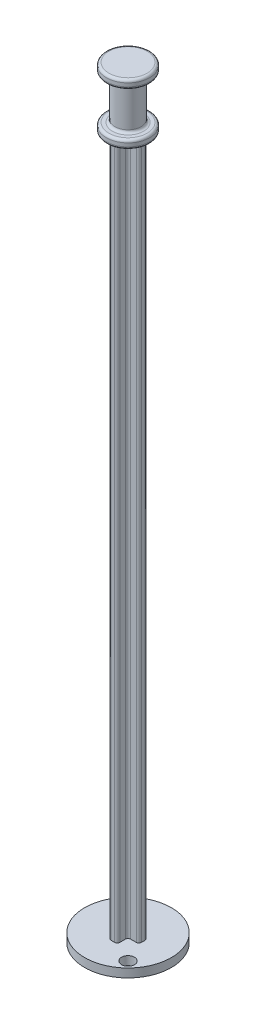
ISO-10303-21;
HEADER;
FILE_DESCRIPTION(('STEP AP214'),'2;1');
FILE_NAME('part.step','',(''),(''),'','','');
FILE_SCHEMA(('AUTOMOTIVE_DESIGN { 1 0 10303 214 1 1 1 1 }'));
ENDSEC;
DATA;
#1=APPLICATION_CONTEXT('core data for automotive mechanical design processes');
#2=APPLICATION_PROTOCOL_DEFINITION('international standard','automotive_design',2000,#1);
#3=PRODUCT_CONTEXT('',#1,'mechanical');
#4=PRODUCT('Part','Part','',(#3));
#5=PRODUCT_RELATED_PRODUCT_CATEGORY('part','',(#4));
#6=PRODUCT_DEFINITION_FORMATION('','',#4);
#7=PRODUCT_DEFINITION_CONTEXT('part definition',#1,'design');
#8=PRODUCT_DEFINITION('design','',#6,#7);
#9=PRODUCT_DEFINITION_SHAPE('','',#8);
#10=(LENGTH_UNIT() NAMED_UNIT(*) SI_UNIT(.MILLI.,.METRE.));
#11=(NAMED_UNIT(*) PLANE_ANGLE_UNIT() SI_UNIT($,.RADIAN.));
#12=(NAMED_UNIT(*) SI_UNIT($,.STERADIAN.) SOLID_ANGLE_UNIT());
#13=UNCERTAINTY_MEASURE_WITH_UNIT(LENGTH_MEASURE(1.E-05),#10,'distance_accuracy_value','');
#14=(GEOMETRIC_REPRESENTATION_CONTEXT(3) GLOBAL_UNCERTAINTY_ASSIGNED_CONTEXT((#13)) GLOBAL_UNIT_ASSIGNED_CONTEXT((#10,
#11,#12)) REPRESENTATION_CONTEXT('',''));
#15=CARTESIAN_POINT('',(0.,0.,0.));
#16=DIRECTION('',(0.,0.,1.));
#17=DIRECTION('',(1.,0.,0.));
#18=AXIS2_PLACEMENT_3D('',#15,#16,#17);
#19=CARTESIAN_POINT('',(0.,-81.,0.));
#20=DIRECTION('',(0.,1.,0.));
#21=DIRECTION('',(0.,0.,1.));
#22=AXIS2_PLACEMENT_3D('',#19,#20,#21);
#23=CYLINDRICAL_SURFACE('',#22,5.);
#24=CARTESIAN_POINT('',(0.,-81.,0.));
#25=DIRECTION('',(0.,-1.,0.));
#26=DIRECTION('',(0.,0.,-1.));
#27=AXIS2_PLACEMENT_3D('',#24,#25,#26);
#28=CIRCLE('',#27,5.);
#29=CARTESIAN_POINT('',(0.,-81.,-5.));
#30=VERTEX_POINT('',#29);
#31=EDGE_CURVE('E11',#30,#30,#28,.T.);
#32=ORIENTED_EDGE('',*,*,#31,.F.);
#33=EDGE_LOOP('',(#32));
#34=FACE_BOUND('',#33,.T.);
#35=CARTESIAN_POINT('',(0.,-80.,0.));
#36=DIRECTION('',(0.,-1.,0.));
#37=DIRECTION('',(0.,0.,-1.));
#38=AXIS2_PLACEMENT_3D('',#35,#36,#37);
#39=CIRCLE('',#38,5.);
#40=CARTESIAN_POINT('',(0.,-80.,-5.));
#41=VERTEX_POINT('',#40);
#42=EDGE_CURVE('E51',#41,#41,#39,.T.);
#43=ORIENTED_EDGE('',*,*,#42,.T.);
#44=EDGE_LOOP('',(#43));
#45=FACE_BOUND('',#44,.T.);
#46=ADVANCED_FACE('F44',(#34,#45),#23,.T.);
#47=CARTESIAN_POINT('',(0.,-81.,0.));
#48=DIRECTION('',(0.,-1.,0.));
#49=DIRECTION('',(0.,0.,-1.));
#50=AXIS2_PLACEMENT_3D('',#47,#48,#49);
#51=PLANE('',#50);
#52=CARTESIAN_POINT('',(2.82842712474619,-81.,2.82842712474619));
#53=DIRECTION('',(0.,-1.,0.));
#54=DIRECTION('',(0.,0.,-1.));
#55=AXIS2_PLACEMENT_3D('',#52,#53,#54);
#56=CIRCLE('',#55,0.75);
#57=CARTESIAN_POINT('',(2.82842712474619,-81.,2.07842712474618));
#58=VERTEX_POINT('',#57);
#59=EDGE_CURVE('E57',#58,#58,#56,.T.);
#60=ORIENTED_EDGE('',*,*,#59,.F.);
#61=EDGE_LOOP('',(#60));
#62=FACE_BOUND('',#61,.T.);
#63=ORIENTED_EDGE('',*,*,#31,.T.);
#64=EDGE_LOOP('',(#63));
#65=FACE_BOUND('',#64,.T.);
#66=ADVANCED_FACE('F73',(#62,#65),#51,.T.);
#67=CARTESIAN_POINT('',(0.,-80.,0.));
#68=DIRECTION('',(0.,-1.,0.));
#69=DIRECTION('',(0.,0.,-1.));
#70=AXIS2_PLACEMENT_3D('',#67,#68,#69);
#71=PLANE('',#70);
#72=CARTESIAN_POINT('',(2.82842712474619,-80.,2.82842712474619));
#73=DIRECTION('',(0.,-1.,0.));
#74=DIRECTION('',(0.,0.,-1.));
#75=AXIS2_PLACEMENT_3D('',#72,#73,#74);
#76=CIRCLE('',#75,0.75);
#77=CARTESIAN_POINT('',(2.82842712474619,-80.,2.07842712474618));
#78=VERTEX_POINT('',#77);
#79=EDGE_CURVE('E47',#78,#78,#76,.T.);
#80=ORIENTED_EDGE('',*,*,#79,.T.);
#81=EDGE_LOOP('',(#80));
#82=FACE_BOUND('',#81,.T.);
#83=ORIENTED_EDGE('',*,*,#42,.F.);
#84=EDGE_LOOP('',(#83));
#85=FACE_BOUND('',#84,.T.);
#86=ADVANCED_FACE('F64',(#82,#85),#71,.F.);
#87=CARTESIAN_POINT('',(2.82842712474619,-78.,2.82842712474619));
#88=DIRECTION('',(0.,-1.,0.));
#89=DIRECTION('',(0.,0.,-1.));
#90=AXIS2_PLACEMENT_3D('',#87,#88,#89);
#91=CYLINDRICAL_SURFACE('',#90,0.75);
#92=ORIENTED_EDGE('',*,*,#59,.T.);
#93=EDGE_LOOP('',(#92));
#94=FACE_BOUND('',#93,.T.);
#95=ORIENTED_EDGE('',*,*,#79,.F.);
#96=EDGE_LOOP('',(#95));
#97=FACE_BOUND('',#96,.T.);
#98=ADVANCED_FACE('F67',(#94,#97),#91,.F.);
#99=CLOSED_SHELL('',(#46,#66,#86,#98));
#100=MANIFOLD_SOLID_BREP('B2',#99);
#101=CARTESIAN_POINT('',(0.8,-80.,0.8));
#102=DIRECTION('',(0.,1.,0.));
#103=DIRECTION('',(0.,0.,1.));
#104=AXIS2_PLACEMENT_3D('',#101,#102,#103);
#105=CYLINDRICAL_SURFACE('',#104,0.3);
#106=CARTESIAN_POINT('',(0.8,0.,0.8));
#107=DIRECTION('',(0.,1.,0.));
#108=DIRECTION('',(0.,0.,1.));
#109=AXIS2_PLACEMENT_3D('',#106,#107,#108);
#110=CIRCLE('',#109,0.3);
#111=CARTESIAN_POINT('',(0.800000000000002,0.,0.500000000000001));
#112=VERTEX_POINT('',#111);
#113=CARTESIAN_POINT('',(0.5,0.,0.800000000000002));
#114=VERTEX_POINT('',#113);
#115=EDGE_CURVE('E305',#112,#114,#110,.T.);
#116=ORIENTED_EDGE('',*,*,#115,.T.);
#117=DIRECTION('',(0.,1.,0.));
#118=VECTOR('',#117,1.);
#119=CARTESIAN_POINT('',(0.5,-80.,0.800000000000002));
#120=LINE('',#119,#118);
#121=CARTESIAN_POINT('',(0.5,-80.,0.800000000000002));
#122=VERTEX_POINT('',#121);
#123=EDGE_CURVE('E42',#122,#114,#120,.T.);
#124=ORIENTED_EDGE('',*,*,#123,.F.);
#125=CARTESIAN_POINT('',(0.8,-80.,0.8));
#126=DIRECTION('',(0.,1.,0.));
#127=DIRECTION('',(0.,0.,1.));
#128=AXIS2_PLACEMENT_3D('',#125,#126,#127);
#129=CIRCLE('',#128,0.3);
#130=CARTESIAN_POINT('',(0.800000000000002,-80.,0.500000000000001));
#131=VERTEX_POINT('',#130);
#132=EDGE_CURVE('E351',#131,#122,#129,.T.);
#133=ORIENTED_EDGE('',*,*,#132,.F.);
#134=DIRECTION('',(0.,1.,0.));
#135=VECTOR('',#134,1.);
#136=CARTESIAN_POINT('',(0.800000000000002,-80.,0.500000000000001));
#137=LINE('',#136,#135);
#138=EDGE_CURVE('E301',#131,#112,#137,.T.);
#139=ORIENTED_EDGE('',*,*,#138,.T.);
#140=EDGE_LOOP('',(#116,#124,#133,#139));
#141=FACE_BOUND('',#140,.T.);
#142=ADVANCED_FACE('F113',(#141),#105,.F.);
#143=CARTESIAN_POINT('',(0.5,-80.,0.800000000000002));
#144=DIRECTION('',(-1.,0.,0.));
#145=DIRECTION('',(0.,0.,1.));
#146=AXIS2_PLACEMENT_3D('',#143,#144,#145);
#147=PLANE('',#146);
#148=DIRECTION('',(0.,0.,1.));
#149=VECTOR('',#148,1.);
#150=CARTESIAN_POINT('',(0.5,0.,0.800000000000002));
#151=LINE('',#150,#149);
#152=CARTESIAN_POINT('',(0.5,0.,1.45));
#153=VERTEX_POINT('',#152);
#154=EDGE_CURVE('E308',#114,#153,#151,.T.);
#155=ORIENTED_EDGE('',*,*,#154,.T.);
#156=DIRECTION('',(0.,1.,0.));
#157=VECTOR('',#156,1.);
#158=CARTESIAN_POINT('',(0.5,-80.,1.45));
#159=LINE('',#158,#157);
#160=CARTESIAN_POINT('',(0.5,-80.,1.45));
#161=VERTEX_POINT('',#160);
#162=EDGE_CURVE('E121',#161,#153,#159,.T.);
#163=ORIENTED_EDGE('',*,*,#162,.F.);
#164=DIRECTION('',(0.,0.,1.));
#165=VECTOR('',#164,1.);
#166=CARTESIAN_POINT('',(0.5,-80.,0.800000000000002));
#167=LINE('',#166,#165);
#168=EDGE_CURVE('E220',#122,#161,#167,.T.);
#169=ORIENTED_EDGE('',*,*,#168,.F.);
#170=ORIENTED_EDGE('',*,*,#123,.T.);
#171=EDGE_LOOP('',(#155,#163,#169,#170));
#172=FACE_BOUND('',#171,.T.);
#173=ADVANCED_FACE('F489',(#172),#147,.F.);
#174=CARTESIAN_POINT('',(0.2,-80.,1.45));
#175=DIRECTION('',(0.,1.,0.));
#176=DIRECTION('',(0.,0.,1.));
#177=AXIS2_PLACEMENT_3D('',#174,#175,#176);
#178=CYLINDRICAL_SURFACE('',#177,0.3);
#179=CARTESIAN_POINT('',(0.2,0.,1.45));
#180=DIRECTION('',(0.,-1.,0.));
#181=DIRECTION('',(0.,0.,-1.));
#182=AXIS2_PLACEMENT_3D('',#179,#180,#181);
#183=CIRCLE('',#182,0.3);
#184=CARTESIAN_POINT('',(0.199999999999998,0.,1.75));
#185=VERTEX_POINT('',#184);
#186=EDGE_CURVE('E310',#153,#185,#183,.T.);
#187=ORIENTED_EDGE('',*,*,#186,.T.);
#188=DIRECTION('',(0.,1.,0.));
#189=VECTOR('',#188,1.);
#190=CARTESIAN_POINT('',(0.199999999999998,-80.,1.75));
#191=LINE('',#190,#189);
#192=CARTESIAN_POINT('',(0.199999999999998,-80.,1.75));
#193=VERTEX_POINT('',#192);
#194=EDGE_CURVE('E406',#193,#185,#191,.T.);
#195=ORIENTED_EDGE('',*,*,#194,.F.);
#196=CARTESIAN_POINT('',(0.2,-80.,1.45));
#197=DIRECTION('',(0.,-1.,0.));
#198=DIRECTION('',(0.,0.,-1.));
#199=AXIS2_PLACEMENT_3D('',#196,#197,#198);
#200=CIRCLE('',#199,0.3);
#201=EDGE_CURVE('E414',#161,#193,#200,.T.);
#202=ORIENTED_EDGE('',*,*,#201,.F.);
#203=ORIENTED_EDGE('',*,*,#162,.T.);
#204=EDGE_LOOP('',(#187,#195,#202,#203));
#205=FACE_BOUND('',#204,.T.);
#206=ADVANCED_FACE('F412',(#205),#178,.T.);
#207=CARTESIAN_POINT('',(0.199999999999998,-80.,1.75));
#208=DIRECTION('',(0.,0.,-1.));
#209=DIRECTION('',(-1.,0.,0.));
#210=AXIS2_PLACEMENT_3D('',#207,#208,#209);
#211=PLANE('',#210);
#212=DIRECTION('',(-1.,0.,0.));
#213=VECTOR('',#212,1.);
#214=CARTESIAN_POINT('',(0.199999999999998,0.,1.75));
#215=LINE('',#214,#213);
#216=CARTESIAN_POINT('',(-0.199999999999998,0.,1.75));
#217=VERTEX_POINT('',#216);
#218=EDGE_CURVE('E312',#185,#217,#215,.T.);
#219=ORIENTED_EDGE('',*,*,#218,.T.);
#220=DIRECTION('',(0.,1.,0.));
#221=VECTOR('',#220,1.);
#222=CARTESIAN_POINT('',(-0.199999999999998,-80.,1.75));
#223=LINE('',#222,#221);
#224=CARTESIAN_POINT('',(-0.199999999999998,-80.,1.75));
#225=VERTEX_POINT('',#224);
#226=EDGE_CURVE('E403',#225,#217,#223,.T.);
#227=ORIENTED_EDGE('',*,*,#226,.F.);
#228=DIRECTION('',(-1.,0.,0.));
#229=VECTOR('',#228,1.);
#230=CARTESIAN_POINT('',(0.199999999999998,-80.,1.75));
#231=LINE('',#230,#229);
#232=EDGE_CURVE('E432',#193,#225,#231,.T.);
#233=ORIENTED_EDGE('',*,*,#232,.F.);
#234=ORIENTED_EDGE('',*,*,#194,.T.);
#235=EDGE_LOOP('',(#219,#227,#233,#234));
#236=FACE_BOUND('',#235,.T.);
#237=ADVANCED_FACE('F423',(#236),#211,.F.);
#238=CARTESIAN_POINT('',(-0.2,-80.,1.45));
#239=DIRECTION('',(0.,1.,0.));
#240=DIRECTION('',(0.,0.,1.));
#241=AXIS2_PLACEMENT_3D('',#238,#239,#240);
#242=CYLINDRICAL_SURFACE('',#241,0.3);
#243=CARTESIAN_POINT('',(-0.2,0.,1.45));
#244=DIRECTION('',(0.,-1.,0.));
#245=DIRECTION('',(0.,0.,1.));
#246=AXIS2_PLACEMENT_3D('',#243,#244,#245);
#247=CIRCLE('',#246,0.3);
#248=CARTESIAN_POINT('',(-0.5,0.,1.45));
#249=VERTEX_POINT('',#248);
#250=EDGE_CURVE('E314',#217,#249,#247,.T.);
#251=ORIENTED_EDGE('',*,*,#250,.T.);
#252=DIRECTION('',(0.,1.,0.));
#253=VECTOR('',#252,1.);
#254=CARTESIAN_POINT('',(-0.5,-80.,1.45));
#255=LINE('',#254,#253);
#256=CARTESIAN_POINT('',(-0.5,-80.,1.45));
#257=VERTEX_POINT('',#256);
#258=EDGE_CURVE('E400',#257,#249,#255,.T.);
#259=ORIENTED_EDGE('',*,*,#258,.F.);
#260=CARTESIAN_POINT('',(-0.2,-80.,1.45));
#261=DIRECTION('',(0.,-1.,0.));
#262=DIRECTION('',(0.,0.,1.));
#263=AXIS2_PLACEMENT_3D('',#260,#261,#262);
#264=CIRCLE('',#263,0.3);
#265=EDGE_CURVE('E429',#225,#257,#264,.T.);
#266=ORIENTED_EDGE('',*,*,#265,.F.);
#267=ORIENTED_EDGE('',*,*,#226,.T.);
#268=EDGE_LOOP('',(#251,#259,#266,#267));
#269=FACE_BOUND('',#268,.T.);
#270=ADVANCED_FACE('F427',(#269),#242,.T.);
#271=CARTESIAN_POINT('',(-0.5,-80.,1.45));
#272=DIRECTION('',(1.,0.,0.));
#273=DIRECTION('',(0.,0.,-1.));
#274=AXIS2_PLACEMENT_3D('',#271,#272,#273);
#275=PLANE('',#274);
#276=DIRECTION('',(0.,0.,-1.));
#277=VECTOR('',#276,1.);
#278=CARTESIAN_POINT('',(-0.5,0.,1.45));
#279=LINE('',#278,#277);
#280=CARTESIAN_POINT('',(-0.5,0.,0.800000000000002));
#281=VERTEX_POINT('',#280);
#282=EDGE_CURVE('E316',#249,#281,#279,.T.);
#283=ORIENTED_EDGE('',*,*,#282,.T.);
#284=DIRECTION('',(0.,1.,0.));
#285=VECTOR('',#284,1.);
#286=CARTESIAN_POINT('',(-0.5,-80.,0.800000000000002));
#287=LINE('',#286,#285);
#288=CARTESIAN_POINT('',(-0.5,-80.,0.800000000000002));
#289=VERTEX_POINT('',#288);
#290=EDGE_CURVE('E397',#289,#281,#287,.T.);
#291=ORIENTED_EDGE('',*,*,#290,.F.);
#292=DIRECTION('',(0.,0.,-1.));
#293=VECTOR('',#292,1.);
#294=CARTESIAN_POINT('',(-0.5,-80.,1.45));
#295=LINE('',#294,#293);
#296=EDGE_CURVE('E431',#257,#289,#295,.T.);
#297=ORIENTED_EDGE('',*,*,#296,.F.);
#298=ORIENTED_EDGE('',*,*,#258,.T.);
#299=EDGE_LOOP('',(#283,#291,#297,#298));
#300=FACE_BOUND('',#299,.T.);
#301=ADVANCED_FACE('F502',(#300),#275,.F.);
#302=CARTESIAN_POINT('',(-0.8,-80.,0.8));
#303=DIRECTION('',(0.,1.,0.));
#304=DIRECTION('',(0.,0.,1.));
#305=AXIS2_PLACEMENT_3D('',#302,#303,#304);
#306=CYLINDRICAL_SURFACE('',#305,0.3);
#307=CARTESIAN_POINT('',(-0.8,0.,0.8));
#308=DIRECTION('',(0.,1.,0.));
#309=DIRECTION('',(0.,0.,1.));
#310=AXIS2_PLACEMENT_3D('',#307,#308,#309);
#311=CIRCLE('',#310,0.3);
#312=CARTESIAN_POINT('',(-0.800000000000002,0.,0.500000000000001));
#313=VERTEX_POINT('',#312);
#314=EDGE_CURVE('E318',#281,#313,#311,.T.);
#315=ORIENTED_EDGE('',*,*,#314,.T.);
#316=DIRECTION('',(0.,1.,0.));
#317=VECTOR('',#316,1.);
#318=CARTESIAN_POINT('',(-0.800000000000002,-80.,0.500000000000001));
#319=LINE('',#318,#317);
#320=CARTESIAN_POINT('',(-0.800000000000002,-80.,0.500000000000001));
#321=VERTEX_POINT('',#320);
#322=EDGE_CURVE('E394',#321,#313,#319,.T.);
#323=ORIENTED_EDGE('',*,*,#322,.F.);
#324=CARTESIAN_POINT('',(-0.8,-80.,0.8));
#325=DIRECTION('',(0.,1.,0.));
#326=DIRECTION('',(0.,0.,1.));
#327=AXIS2_PLACEMENT_3D('',#324,#325,#326);
#328=CIRCLE('',#327,0.3);
#329=EDGE_CURVE('E434',#289,#321,#328,.T.);
#330=ORIENTED_EDGE('',*,*,#329,.F.);
#331=ORIENTED_EDGE('',*,*,#290,.T.);
#332=EDGE_LOOP('',(#315,#323,#330,#331));
#333=FACE_BOUND('',#332,.T.);
#334=ADVANCED_FACE('F505',(#333),#306,.F.);
#335=CARTESIAN_POINT('',(-0.800000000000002,-80.,0.500000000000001));
#336=DIRECTION('',(0.,0.,-1.));
#337=DIRECTION('',(-1.,0.,0.));
#338=AXIS2_PLACEMENT_3D('',#335,#336,#337);
#339=PLANE('',#338);
#340=DIRECTION('',(-1.,0.,0.));
#341=VECTOR('',#340,1.);
#342=CARTESIAN_POINT('',(-0.800000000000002,0.,0.500000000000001));
#343=LINE('',#342,#341);
#344=CARTESIAN_POINT('',(-1.45,0.,0.5));
#345=VERTEX_POINT('',#344);
#346=EDGE_CURVE('E320',#313,#345,#343,.T.);
#347=ORIENTED_EDGE('',*,*,#346,.T.);
#348=DIRECTION('',(0.,1.,0.));
#349=VECTOR('',#348,1.);
#350=CARTESIAN_POINT('',(-1.45,-80.,0.5));
#351=LINE('',#350,#349);
#352=CARTESIAN_POINT('',(-1.45,-80.,0.5));
#353=VERTEX_POINT('',#352);
#354=EDGE_CURVE('E391',#353,#345,#351,.T.);
#355=ORIENTED_EDGE('',*,*,#354,.F.);
#356=DIRECTION('',(-1.,0.,0.));
#357=VECTOR('',#356,1.);
#358=CARTESIAN_POINT('',(-0.800000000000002,-80.,0.500000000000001));
#359=LINE('',#358,#357);
#360=EDGE_CURVE('E440',#321,#353,#359,.T.);
#361=ORIENTED_EDGE('',*,*,#360,.F.);
#362=ORIENTED_EDGE('',*,*,#322,.T.);
#363=EDGE_LOOP('',(#347,#355,#361,#362));
#364=FACE_BOUND('',#363,.T.);
#365=ADVANCED_FACE('F509',(#364),#339,.F.);
#366=CARTESIAN_POINT('',(-1.45,-80.,0.2));
#367=DIRECTION('',(0.,1.,0.));
#368=DIRECTION('',(0.,0.,1.));
#369=AXIS2_PLACEMENT_3D('',#366,#367,#368);
#370=CYLINDRICAL_SURFACE('',#369,0.3);
#371=CARTESIAN_POINT('',(-1.45,0.,0.2));
#372=DIRECTION('',(0.,-1.,0.));
#373=DIRECTION('',(0.,0.,-1.));
#374=AXIS2_PLACEMENT_3D('',#371,#372,#373);
#375=CIRCLE('',#374,0.3);
#376=CARTESIAN_POINT('',(-1.75,0.,0.199999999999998));
#377=VERTEX_POINT('',#376);
#378=EDGE_CURVE('E322',#345,#377,#375,.T.);
#379=ORIENTED_EDGE('',*,*,#378,.T.);
#380=DIRECTION('',(0.,1.,0.));
#381=VECTOR('',#380,1.);
#382=CARTESIAN_POINT('',(-1.75,-80.,0.199999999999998));
#383=LINE('',#382,#381);
#384=CARTESIAN_POINT('',(-1.75,-80.,0.199999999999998));
#385=VERTEX_POINT('',#384);
#386=EDGE_CURVE('E388',#385,#377,#383,.T.);
#387=ORIENTED_EDGE('',*,*,#386,.F.);
#388=CARTESIAN_POINT('',(-1.45,-80.,0.2));
#389=DIRECTION('',(0.,-1.,0.));
#390=DIRECTION('',(0.,0.,-1.));
#391=AXIS2_PLACEMENT_3D('',#388,#389,#390);
#392=CIRCLE('',#391,0.3);
#393=EDGE_CURVE('E442',#353,#385,#392,.T.);
#394=ORIENTED_EDGE('',*,*,#393,.F.);
#395=ORIENTED_EDGE('',*,*,#354,.T.);
#396=EDGE_LOOP('',(#379,#387,#394,#395));
#397=FACE_BOUND('',#396,.T.);
#398=ADVANCED_FACE('F513',(#397),#370,.T.);
#399=CARTESIAN_POINT('',(-1.75,-80.,0.199999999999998));
#400=DIRECTION('',(1.,0.,0.));
#401=DIRECTION('',(0.,0.,-1.));
#402=AXIS2_PLACEMENT_3D('',#399,#400,#401);
#403=PLANE('',#402);
#404=DIRECTION('',(0.,0.,-1.));
#405=VECTOR('',#404,1.);
#406=CARTESIAN_POINT('',(-1.75,0.,0.199999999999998));
#407=LINE('',#406,#405);
#408=CARTESIAN_POINT('',(-1.75,0.,-0.199999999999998));
#409=VERTEX_POINT('',#408);
#410=EDGE_CURVE('E324',#377,#409,#407,.T.);
#411=ORIENTED_EDGE('',*,*,#410,.T.);
#412=DIRECTION('',(0.,1.,0.));
#413=VECTOR('',#412,1.);
#414=CARTESIAN_POINT('',(-1.75,-80.,-0.199999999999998));
#415=LINE('',#414,#413);
#416=CARTESIAN_POINT('',(-1.75,-80.,-0.199999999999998));
#417=VERTEX_POINT('',#416);
#418=EDGE_CURVE('E385',#417,#409,#415,.T.);
#419=ORIENTED_EDGE('',*,*,#418,.F.);
#420=DIRECTION('',(0.,0.,-1.));
#421=VECTOR('',#420,1.);
#422=CARTESIAN_POINT('',(-1.75,-80.,0.199999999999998));
#423=LINE('',#422,#421);
#424=EDGE_CURVE('E444',#385,#417,#423,.T.);
#425=ORIENTED_EDGE('',*,*,#424,.F.);
#426=ORIENTED_EDGE('',*,*,#386,.T.);
#427=EDGE_LOOP('',(#411,#419,#425,#426));
#428=FACE_BOUND('',#427,.T.);
#429=ADVANCED_FACE('F517',(#428),#403,.F.);
#430=CARTESIAN_POINT('',(-1.45,-80.,-0.2));
#431=DIRECTION('',(0.,1.,0.));
#432=DIRECTION('',(0.,0.,1.));
#433=AXIS2_PLACEMENT_3D('',#430,#431,#432);
#434=CYLINDRICAL_SURFACE('',#433,0.3);
#435=CARTESIAN_POINT('',(-1.45,0.,-0.2));
#436=DIRECTION('',(0.,-1.,0.));
#437=DIRECTION('',(0.,0.,-1.));
#438=AXIS2_PLACEMENT_3D('',#435,#436,#437);
#439=CIRCLE('',#438,0.3);
#440=CARTESIAN_POINT('',(-1.45,0.,-0.5));
#441=VERTEX_POINT('',#440);
#442=EDGE_CURVE('E326',#409,#441,#439,.T.);
#443=ORIENTED_EDGE('',*,*,#442,.T.);
#444=DIRECTION('',(0.,1.,0.));
#445=VECTOR('',#444,1.);
#446=CARTESIAN_POINT('',(-1.45,-80.,-0.5));
#447=LINE('',#446,#445);
#448=CARTESIAN_POINT('',(-1.45,-80.,-0.5));
#449=VERTEX_POINT('',#448);
#450=EDGE_CURVE('E382',#449,#441,#447,.T.);
#451=ORIENTED_EDGE('',*,*,#450,.F.);
#452=CARTESIAN_POINT('',(-1.45,-80.,-0.2));
#453=DIRECTION('',(0.,-1.,0.));
#454=DIRECTION('',(0.,0.,-1.));
#455=AXIS2_PLACEMENT_3D('',#452,#453,#454);
#456=CIRCLE('',#455,0.3);
#457=EDGE_CURVE('E446',#417,#449,#456,.T.);
#458=ORIENTED_EDGE('',*,*,#457,.F.);
#459=ORIENTED_EDGE('',*,*,#418,.T.);
#460=EDGE_LOOP('',(#443,#451,#458,#459));
#461=FACE_BOUND('',#460,.T.);
#462=ADVANCED_FACE('F521',(#461),#434,.T.);
#463=CARTESIAN_POINT('',(-1.45,-80.,-0.5));
#464=DIRECTION('',(0.,0.,1.));
#465=DIRECTION('',(1.,0.,0.));
#466=AXIS2_PLACEMENT_3D('',#463,#464,#465);
#467=PLANE('',#466);
#468=DIRECTION('',(1.,0.,0.));
#469=VECTOR('',#468,1.);
#470=CARTESIAN_POINT('',(-1.45,0.,-0.5));
#471=LINE('',#470,#469);
#472=CARTESIAN_POINT('',(-0.800000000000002,0.,-0.5));
#473=VERTEX_POINT('',#472);
#474=EDGE_CURVE('E328',#441,#473,#471,.T.);
#475=ORIENTED_EDGE('',*,*,#474,.T.);
#476=DIRECTION('',(0.,1.,0.));
#477=VECTOR('',#476,1.);
#478=CARTESIAN_POINT('',(-0.800000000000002,-80.,-0.5));
#479=LINE('',#478,#477);
#480=CARTESIAN_POINT('',(-0.800000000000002,-80.,-0.5));
#481=VERTEX_POINT('',#480);
#482=EDGE_CURVE('E379',#481,#473,#479,.T.);
#483=ORIENTED_EDGE('',*,*,#482,.F.);
#484=DIRECTION('',(1.,0.,0.));
#485=VECTOR('',#484,1.);
#486=CARTESIAN_POINT('',(-1.45,-80.,-0.5));
#487=LINE('',#486,#485);
#488=EDGE_CURVE('E448',#449,#481,#487,.T.);
#489=ORIENTED_EDGE('',*,*,#488,.F.);
#490=ORIENTED_EDGE('',*,*,#450,.T.);
#491=EDGE_LOOP('',(#475,#483,#489,#490));
#492=FACE_BOUND('',#491,.T.);
#493=ADVANCED_FACE('F525',(#492),#467,.F.);
#494=CARTESIAN_POINT('',(-0.8,-80.,-0.8));
#495=DIRECTION('',(0.,1.,0.));
#496=DIRECTION('',(0.,0.,1.));
#497=AXIS2_PLACEMENT_3D('',#494,#495,#496);
#498=CYLINDRICAL_SURFACE('',#497,0.3);
#499=CARTESIAN_POINT('',(-0.8,0.,-0.8));
#500=DIRECTION('',(0.,1.,0.));
#501=DIRECTION('',(0.,0.,1.));
#502=AXIS2_PLACEMENT_3D('',#499,#500,#501);
#503=CIRCLE('',#502,0.3);
#504=CARTESIAN_POINT('',(-0.5,0.,-0.800000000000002));
#505=VERTEX_POINT('',#504);
#506=EDGE_CURVE('E330',#473,#505,#503,.T.);
#507=ORIENTED_EDGE('',*,*,#506,.T.);
#508=DIRECTION('',(0.,1.,0.));
#509=VECTOR('',#508,1.);
#510=CARTESIAN_POINT('',(-0.5,-80.,-0.800000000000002));
#511=LINE('',#510,#509);
#512=CARTESIAN_POINT('',(-0.5,-80.,-0.800000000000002));
#513=VERTEX_POINT('',#512);
#514=EDGE_CURVE('E376',#513,#505,#511,.T.);
#515=ORIENTED_EDGE('',*,*,#514,.F.);
#516=CARTESIAN_POINT('',(-0.8,-80.,-0.8));
#517=DIRECTION('',(0.,1.,0.));
#518=DIRECTION('',(0.,0.,1.));
#519=AXIS2_PLACEMENT_3D('',#516,#517,#518);
#520=CIRCLE('',#519,0.3);
#521=EDGE_CURVE('E450',#481,#513,#520,.T.);
#522=ORIENTED_EDGE('',*,*,#521,.F.);
#523=ORIENTED_EDGE('',*,*,#482,.T.);
#524=EDGE_LOOP('',(#507,#515,#522,#523));
#525=FACE_BOUND('',#524,.T.);
#526=ADVANCED_FACE('F529',(#525),#498,.F.);
#527=CARTESIAN_POINT('',(-0.5,-80.,-0.800000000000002));
#528=DIRECTION('',(1.,0.,0.));
#529=DIRECTION('',(0.,0.,-1.));
#530=AXIS2_PLACEMENT_3D('',#527,#528,#529);
#531=PLANE('',#530);
#532=DIRECTION('',(0.,0.,-1.));
#533=VECTOR('',#532,1.);
#534=CARTESIAN_POINT('',(-0.5,0.,-0.800000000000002));
#535=LINE('',#534,#533);
#536=CARTESIAN_POINT('',(-0.5,0.,-1.45));
#537=VERTEX_POINT('',#536);
#538=EDGE_CURVE('E332',#505,#537,#535,.T.);
#539=ORIENTED_EDGE('',*,*,#538,.T.);
#540=DIRECTION('',(0.,1.,0.));
#541=VECTOR('',#540,1.);
#542=CARTESIAN_POINT('',(-0.5,-80.,-1.45));
#543=LINE('',#542,#541);
#544=CARTESIAN_POINT('',(-0.5,-80.,-1.45));
#545=VERTEX_POINT('',#544);
#546=EDGE_CURVE('E373',#545,#537,#543,.T.);
#547=ORIENTED_EDGE('',*,*,#546,.F.);
#548=DIRECTION('',(0.,0.,-1.));
#549=VECTOR('',#548,1.);
#550=CARTESIAN_POINT('',(-0.5,-80.,-0.800000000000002));
#551=LINE('',#550,#549);
#552=EDGE_CURVE('E452',#513,#545,#551,.T.);
#553=ORIENTED_EDGE('',*,*,#552,.F.);
#554=ORIENTED_EDGE('',*,*,#514,.T.);
#555=EDGE_LOOP('',(#539,#547,#553,#554));
#556=FACE_BOUND('',#555,.T.);
#557=ADVANCED_FACE('F533',(#556),#531,.F.);
#558=CARTESIAN_POINT('',(-0.2,-80.,-1.45));
#559=DIRECTION('',(0.,1.,0.));
#560=DIRECTION('',(0.,0.,1.));
#561=AXIS2_PLACEMENT_3D('',#558,#559,#560);
#562=CYLINDRICAL_SURFACE('',#561,0.3);
#563=CARTESIAN_POINT('',(-0.2,0.,-1.45));
#564=DIRECTION('',(0.,-1.,0.));
#565=DIRECTION('',(0.,0.,-1.));
#566=AXIS2_PLACEMENT_3D('',#563,#564,#565);
#567=CIRCLE('',#566,0.3);
#568=CARTESIAN_POINT('',(-0.2,0.,-1.75));
#569=VERTEX_POINT('',#568);
#570=EDGE_CURVE('E334',#537,#569,#567,.T.);
#571=ORIENTED_EDGE('',*,*,#570,.T.);
#572=DIRECTION('',(0.,1.,0.));
#573=VECTOR('',#572,1.);
#574=CARTESIAN_POINT('',(-0.2,-80.,-1.75));
#575=LINE('',#574,#573);
#576=CARTESIAN_POINT('',(-0.2,-80.,-1.75));
#577=VERTEX_POINT('',#576);
#578=EDGE_CURVE('E370',#577,#569,#575,.T.);
#579=ORIENTED_EDGE('',*,*,#578,.F.);
#580=CARTESIAN_POINT('',(-0.2,-80.,-1.45));
#581=DIRECTION('',(0.,-1.,0.));
#582=DIRECTION('',(0.,0.,-1.));
#583=AXIS2_PLACEMENT_3D('',#580,#581,#582);
#584=CIRCLE('',#583,0.3);
#585=EDGE_CURVE('E454',#545,#577,#584,.T.);
#586=ORIENTED_EDGE('',*,*,#585,.F.);
#587=ORIENTED_EDGE('',*,*,#546,.T.);
#588=EDGE_LOOP('',(#571,#579,#586,#587));
#589=FACE_BOUND('',#588,.T.);
#590=ADVANCED_FACE('F537',(#589),#562,.T.);
#591=CARTESIAN_POINT('',(-0.2,-80.,-1.75));
#592=DIRECTION('',(0.,0.,1.));
#593=DIRECTION('',(1.,0.,0.));
#594=AXIS2_PLACEMENT_3D('',#591,#592,#593);
#595=PLANE('',#594);
#596=DIRECTION('',(1.,0.,0.));
#597=VECTOR('',#596,1.);
#598=CARTESIAN_POINT('',(-0.2,0.,-1.75));
#599=LINE('',#598,#597);
#600=CARTESIAN_POINT('',(0.2,0.,-1.75));
#601=VERTEX_POINT('',#600);
#602=EDGE_CURVE('E336',#569,#601,#599,.T.);
#603=ORIENTED_EDGE('',*,*,#602,.T.);
#604=DIRECTION('',(0.,1.,0.));
#605=VECTOR('',#604,1.);
#606=CARTESIAN_POINT('',(0.2,-80.,-1.75));
#607=LINE('',#606,#605);
#608=CARTESIAN_POINT('',(0.2,-80.,-1.75));
#609=VERTEX_POINT('',#608);
#610=EDGE_CURVE('E367',#609,#601,#607,.T.);
#611=ORIENTED_EDGE('',*,*,#610,.F.);
#612=DIRECTION('',(1.,0.,0.));
#613=VECTOR('',#612,1.);
#614=CARTESIAN_POINT('',(-0.2,-80.,-1.75));
#615=LINE('',#614,#613);
#616=EDGE_CURVE('E456',#577,#609,#615,.T.);
#617=ORIENTED_EDGE('',*,*,#616,.F.);
#618=ORIENTED_EDGE('',*,*,#578,.T.);
#619=EDGE_LOOP('',(#603,#611,#617,#618));
#620=FACE_BOUND('',#619,.T.);
#621=ADVANCED_FACE('F541',(#620),#595,.F.);
#622=CARTESIAN_POINT('',(0.2,-80.,-1.45));
#623=DIRECTION('',(0.,1.,0.));
#624=DIRECTION('',(0.,0.,1.));
#625=AXIS2_PLACEMENT_3D('',#622,#623,#624);
#626=CYLINDRICAL_SURFACE('',#625,0.3);
#627=CARTESIAN_POINT('',(0.2,0.,-1.45));
#628=DIRECTION('',(0.,-1.,0.));
#629=DIRECTION('',(0.,0.,-1.));
#630=AXIS2_PLACEMENT_3D('',#627,#628,#629);
#631=CIRCLE('',#630,0.3);
#632=CARTESIAN_POINT('',(0.5,0.,-1.45));
#633=VERTEX_POINT('',#632);
#634=EDGE_CURVE('E338',#601,#633,#631,.T.);
#635=ORIENTED_EDGE('',*,*,#634,.T.);
#636=DIRECTION('',(0.,1.,0.));
#637=VECTOR('',#636,1.);
#638=CARTESIAN_POINT('',(0.5,-80.,-1.45));
#639=LINE('',#638,#637);
#640=CARTESIAN_POINT('',(0.5,-80.,-1.45));
#641=VERTEX_POINT('',#640);
#642=EDGE_CURVE('E364',#641,#633,#639,.T.);
#643=ORIENTED_EDGE('',*,*,#642,.F.);
#644=CARTESIAN_POINT('',(0.2,-80.,-1.45));
#645=DIRECTION('',(0.,-1.,0.));
#646=DIRECTION('',(0.,0.,-1.));
#647=AXIS2_PLACEMENT_3D('',#644,#645,#646);
#648=CIRCLE('',#647,0.3);
#649=EDGE_CURVE('E458',#609,#641,#648,.T.);
#650=ORIENTED_EDGE('',*,*,#649,.F.);
#651=ORIENTED_EDGE('',*,*,#610,.T.);
#652=EDGE_LOOP('',(#635,#643,#650,#651));
#653=FACE_BOUND('',#652,.T.);
#654=ADVANCED_FACE('F545',(#653),#626,.T.);
#655=CARTESIAN_POINT('',(0.5,-80.,-1.45));
#656=DIRECTION('',(-1.,0.,0.));
#657=DIRECTION('',(0.,0.,1.));
#658=AXIS2_PLACEMENT_3D('',#655,#656,#657);
#659=PLANE('',#658);
#660=DIRECTION('',(0.,0.,1.));
#661=VECTOR('',#660,1.);
#662=CARTESIAN_POINT('',(0.5,0.,-1.45));
#663=LINE('',#662,#661);
#664=CARTESIAN_POINT('',(0.5,0.,-0.800000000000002));
#665=VERTEX_POINT('',#664);
#666=EDGE_CURVE('E340',#633,#665,#663,.T.);
#667=ORIENTED_EDGE('',*,*,#666,.T.);
#668=DIRECTION('',(0.,1.,0.));
#669=VECTOR('',#668,1.);
#670=CARTESIAN_POINT('',(0.5,-80.,-0.800000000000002));
#671=LINE('',#670,#669);
#672=CARTESIAN_POINT('',(0.5,-80.,-0.800000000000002));
#673=VERTEX_POINT('',#672);
#674=EDGE_CURVE('E361',#673,#665,#671,.T.);
#675=ORIENTED_EDGE('',*,*,#674,.F.);
#676=DIRECTION('',(0.,0.,1.));
#677=VECTOR('',#676,1.);
#678=CARTESIAN_POINT('',(0.5,-80.,-1.45));
#679=LINE('',#678,#677);
#680=EDGE_CURVE('E460',#641,#673,#679,.T.);
#681=ORIENTED_EDGE('',*,*,#680,.F.);
#682=ORIENTED_EDGE('',*,*,#642,.T.);
#683=EDGE_LOOP('',(#667,#675,#681,#682));
#684=FACE_BOUND('',#683,.T.);
#685=ADVANCED_FACE('F549',(#684),#659,.F.);
#686=CARTESIAN_POINT('',(0.8,-80.,-0.799999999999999));
#687=DIRECTION('',(0.,1.,0.));
#688=DIRECTION('',(0.,0.,1.));
#689=AXIS2_PLACEMENT_3D('',#686,#687,#688);
#690=CYLINDRICAL_SURFACE('',#689,0.3);
#691=CARTESIAN_POINT('',(0.8,0.,-0.799999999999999));
#692=DIRECTION('',(0.,1.,0.));
#693=DIRECTION('',(0.,0.,1.));
#694=AXIS2_PLACEMENT_3D('',#691,#692,#693);
#695=CIRCLE('',#694,0.3);
#696=CARTESIAN_POINT('',(0.800000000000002,0.,-0.5));
#697=VERTEX_POINT('',#696);
#698=EDGE_CURVE('E342',#665,#697,#695,.T.);
#699=ORIENTED_EDGE('',*,*,#698,.T.);
#700=DIRECTION('',(0.,1.,0.));
#701=VECTOR('',#700,1.);
#702=CARTESIAN_POINT('',(0.800000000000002,-80.,-0.5));
#703=LINE('',#702,#701);
#704=CARTESIAN_POINT('',(0.800000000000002,-80.,-0.5));
#705=VERTEX_POINT('',#704);
#706=EDGE_CURVE('E358',#705,#697,#703,.T.);
#707=ORIENTED_EDGE('',*,*,#706,.F.);
#708=CARTESIAN_POINT('',(0.8,-80.,-0.799999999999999));
#709=DIRECTION('',(0.,1.,0.));
#710=DIRECTION('',(0.,0.,1.));
#711=AXIS2_PLACEMENT_3D('',#708,#709,#710);
#712=CIRCLE('',#711,0.3);
#713=EDGE_CURVE('E462',#673,#705,#712,.T.);
#714=ORIENTED_EDGE('',*,*,#713,.F.);
#715=ORIENTED_EDGE('',*,*,#674,.T.);
#716=EDGE_LOOP('',(#699,#707,#714,#715));
#717=FACE_BOUND('',#716,.T.);
#718=ADVANCED_FACE('F553',(#717),#690,.F.);
#719=CARTESIAN_POINT('',(0.800000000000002,-80.,-0.5));
#720=DIRECTION('',(0.,0.,1.));
#721=DIRECTION('',(1.,0.,0.));
#722=AXIS2_PLACEMENT_3D('',#719,#720,#721);
#723=PLANE('',#722);
#724=DIRECTION('',(1.,0.,0.));
#725=VECTOR('',#724,1.);
#726=CARTESIAN_POINT('',(0.800000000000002,0.,-0.5));
#727=LINE('',#726,#725);
#728=CARTESIAN_POINT('',(1.45,0.,-0.5));
#729=VERTEX_POINT('',#728);
#730=EDGE_CURVE('E344',#697,#729,#727,.T.);
#731=ORIENTED_EDGE('',*,*,#730,.T.);
#732=DIRECTION('',(0.,1.,0.));
#733=VECTOR('',#732,1.);
#734=CARTESIAN_POINT('',(1.45,-80.,-0.5));
#735=LINE('',#734,#733);
#736=CARTESIAN_POINT('',(1.45,-80.,-0.5));
#737=VERTEX_POINT('',#736);
#738=EDGE_CURVE('E355',#737,#729,#735,.T.);
#739=ORIENTED_EDGE('',*,*,#738,.F.);
#740=DIRECTION('',(1.,0.,0.));
#741=VECTOR('',#740,1.);
#742=CARTESIAN_POINT('',(0.800000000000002,-80.,-0.5));
#743=LINE('',#742,#741);
#744=EDGE_CURVE('E464',#705,#737,#743,.T.);
#745=ORIENTED_EDGE('',*,*,#744,.F.);
#746=ORIENTED_EDGE('',*,*,#706,.T.);
#747=EDGE_LOOP('',(#731,#739,#745,#746));
#748=FACE_BOUND('',#747,.T.);
#749=ADVANCED_FACE('F470',(#748),#723,.F.);
#750=CARTESIAN_POINT('',(1.45,-80.,-0.2));
#751=DIRECTION('',(0.,1.,0.));
#752=DIRECTION('',(0.,0.,1.));
#753=AXIS2_PLACEMENT_3D('',#750,#751,#752);
#754=CYLINDRICAL_SURFACE('',#753,0.3);
#755=CARTESIAN_POINT('',(1.45,0.,-0.2));
#756=DIRECTION('',(0.,-1.,0.));
#757=DIRECTION('',(0.,0.,-1.));
#758=AXIS2_PLACEMENT_3D('',#755,#756,#757);
#759=CIRCLE('',#758,0.3);
#760=CARTESIAN_POINT('',(1.75,0.,-0.199999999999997));
#761=VERTEX_POINT('',#760);
#762=EDGE_CURVE('E346',#729,#761,#759,.T.);
#763=ORIENTED_EDGE('',*,*,#762,.T.);
#764=DIRECTION('',(0.,1.,0.));
#765=VECTOR('',#764,1.);
#766=CARTESIAN_POINT('',(1.75,-80.,-0.199999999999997));
#767=LINE('',#766,#765);
#768=CARTESIAN_POINT('',(1.75,-80.,-0.199999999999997));
#769=VERTEX_POINT('',#768);
#770=EDGE_CURVE('E296',#769,#761,#767,.T.);
#771=ORIENTED_EDGE('',*,*,#770,.F.);
#772=CARTESIAN_POINT('',(1.45,-80.,-0.2));
#773=DIRECTION('',(0.,-1.,0.));
#774=DIRECTION('',(0.,0.,-1.));
#775=AXIS2_PLACEMENT_3D('',#772,#773,#774);
#776=CIRCLE('',#775,0.3);
#777=EDGE_CURVE('E287',#737,#769,#776,.T.);
#778=ORIENTED_EDGE('',*,*,#777,.F.);
#779=ORIENTED_EDGE('',*,*,#738,.T.);
#780=EDGE_LOOP('',(#763,#771,#778,#779));
#781=FACE_BOUND('',#780,.T.);
#782=ADVANCED_FACE('F474',(#781),#754,.T.);
#783=CARTESIAN_POINT('',(1.75,-80.,-0.199999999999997));
#784=DIRECTION('',(-1.,0.,0.));
#785=DIRECTION('',(0.,0.,1.));
#786=AXIS2_PLACEMENT_3D('',#783,#784,#785);
#787=PLANE('',#786);
#788=DIRECTION('',(0.,0.,1.));
#789=VECTOR('',#788,1.);
#790=CARTESIAN_POINT('',(1.75,0.,-0.199999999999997));
#791=LINE('',#790,#789);
#792=CARTESIAN_POINT('',(1.75,0.,0.199999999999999));
#793=VERTEX_POINT('',#792);
#794=EDGE_CURVE('E295',#761,#793,#791,.T.);
#795=ORIENTED_EDGE('',*,*,#794,.T.);
#796=DIRECTION('',(0.,1.,0.));
#797=VECTOR('',#796,1.);
#798=CARTESIAN_POINT('',(1.75,-80.,0.199999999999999));
#799=LINE('',#798,#797);
#800=CARTESIAN_POINT('',(1.75,-80.,0.199999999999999));
#801=VERTEX_POINT('',#800);
#802=EDGE_CURVE('E292',#801,#793,#799,.T.);
#803=ORIENTED_EDGE('',*,*,#802,.F.);
#804=DIRECTION('',(0.,0.,1.));
#805=VECTOR('',#804,1.);
#806=CARTESIAN_POINT('',(1.75,-80.,-0.199999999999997));
#807=LINE('',#806,#805);
#808=EDGE_CURVE('E281',#769,#801,#807,.T.);
#809=ORIENTED_EDGE('',*,*,#808,.F.);
#810=ORIENTED_EDGE('',*,*,#770,.T.);
#811=EDGE_LOOP('',(#795,#803,#809,#810));
#812=FACE_BOUND('',#811,.T.);
#813=ADVANCED_FACE('F293',(#812),#787,.F.);
#814=CARTESIAN_POINT('',(1.45,-80.,0.200000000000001));
#815=DIRECTION('',(0.,1.,0.));
#816=DIRECTION('',(0.,0.,1.));
#817=AXIS2_PLACEMENT_3D('',#814,#815,#816);
#818=CYLINDRICAL_SURFACE('',#817,0.3);
#819=CARTESIAN_POINT('',(1.45,0.,0.200000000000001));
#820=DIRECTION('',(0.,-1.,0.));
#821=DIRECTION('',(0.,0.,-1.));
#822=AXIS2_PLACEMENT_3D('',#819,#820,#821);
#823=CIRCLE('',#822,0.3);
#824=CARTESIAN_POINT('',(1.45,0.,0.5));
#825=VERTEX_POINT('',#824);
#826=EDGE_CURVE('E206',#793,#825,#823,.T.);
#827=ORIENTED_EDGE('',*,*,#826,.T.);
#828=DIRECTION('',(0.,1.,0.));
#829=VECTOR('',#828,1.);
#830=CARTESIAN_POINT('',(1.45,-80.,0.5));
#831=LINE('',#830,#829);
#832=CARTESIAN_POINT('',(1.45,-80.,0.5));
#833=VERTEX_POINT('',#832);
#834=EDGE_CURVE('E297',#833,#825,#831,.T.);
#835=ORIENTED_EDGE('',*,*,#834,.F.);
#836=CARTESIAN_POINT('',(1.45,-80.,0.200000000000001));
#837=DIRECTION('',(0.,-1.,0.));
#838=DIRECTION('',(0.,0.,-1.));
#839=AXIS2_PLACEMENT_3D('',#836,#837,#838);
#840=CIRCLE('',#839,0.3);
#841=EDGE_CURVE('E285',#801,#833,#840,.T.);
#842=ORIENTED_EDGE('',*,*,#841,.F.);
#843=ORIENTED_EDGE('',*,*,#802,.T.);
#844=EDGE_LOOP('',(#827,#835,#842,#843));
#845=FACE_BOUND('',#844,.T.);
#846=ADVANCED_FACE('F299',(#845),#818,.T.);
#847=CARTESIAN_POINT('',(1.45,-80.,0.5));
#848=DIRECTION('',(0.,0.,-1.));
#849=DIRECTION('',(-1.,0.,0.));
#850=AXIS2_PLACEMENT_3D('',#847,#848,#849);
#851=PLANE('',#850);
#852=DIRECTION('',(-1.,0.,0.));
#853=VECTOR('',#852,1.);
#854=CARTESIAN_POINT('',(1.45,0.,0.5));
#855=LINE('',#854,#853);
#856=EDGE_CURVE('E212',#825,#112,#855,.T.);
#857=ORIENTED_EDGE('',*,*,#856,.T.);
#858=ORIENTED_EDGE('',*,*,#138,.F.);
#859=DIRECTION('',(-1.,0.,0.));
#860=VECTOR('',#859,1.);
#861=CARTESIAN_POINT('',(1.45,-80.,0.5));
#862=LINE('',#861,#860);
#863=EDGE_CURVE('E129',#833,#131,#862,.T.);
#864=ORIENTED_EDGE('',*,*,#863,.F.);
#865=ORIENTED_EDGE('',*,*,#834,.T.);
#866=EDGE_LOOP('',(#857,#858,#864,#865));
#867=FACE_BOUND('',#866,.T.);
#868=ADVANCED_FACE('F478',(#867),#851,.F.);
#869=CARTESIAN_POINT('',(0.8,-80.,0.8));
#870=DIRECTION('',(0.,1.,0.));
#871=DIRECTION('',(0.,0.,1.));
#872=AXIS2_PLACEMENT_3D('',#869,#870,#871);
#873=PLANE('',#872);
#874=ORIENTED_EDGE('',*,*,#132,.T.);
#875=ORIENTED_EDGE('',*,*,#168,.T.);
#876=ORIENTED_EDGE('',*,*,#201,.T.);
#877=ORIENTED_EDGE('',*,*,#232,.T.);
#878=ORIENTED_EDGE('',*,*,#265,.T.);
#879=ORIENTED_EDGE('',*,*,#296,.T.);
#880=ORIENTED_EDGE('',*,*,#329,.T.);
#881=ORIENTED_EDGE('',*,*,#360,.T.);
#882=ORIENTED_EDGE('',*,*,#393,.T.);
#883=ORIENTED_EDGE('',*,*,#424,.T.);
#884=ORIENTED_EDGE('',*,*,#457,.T.);
#885=ORIENTED_EDGE('',*,*,#488,.T.);
#886=ORIENTED_EDGE('',*,*,#521,.T.);
#887=ORIENTED_EDGE('',*,*,#552,.T.);
#888=ORIENTED_EDGE('',*,*,#585,.T.);
#889=ORIENTED_EDGE('',*,*,#616,.T.);
#890=ORIENTED_EDGE('',*,*,#649,.T.);
#891=ORIENTED_EDGE('',*,*,#680,.T.);
#892=ORIENTED_EDGE('',*,*,#713,.T.);
#893=ORIENTED_EDGE('',*,*,#744,.T.);
#894=ORIENTED_EDGE('',*,*,#777,.T.);
#895=ORIENTED_EDGE('',*,*,#808,.T.);
#896=ORIENTED_EDGE('',*,*,#841,.T.);
#897=ORIENTED_EDGE('',*,*,#863,.T.);
#898=EDGE_LOOP('',(#874,#875,#876,#877,#878,#879,#880,#881,#882,#883,#884,#885,#886,#887,#888,
#889,#890,#891,#892,#893,#894,#895,#896,#897));
#899=FACE_BOUND('',#898,.T.);
#900=ADVANCED_FACE('F283',(#899),#873,.F.);
#901=CARTESIAN_POINT('',(0.8,0.,0.8));
#902=DIRECTION('',(0.,1.,0.));
#903=DIRECTION('',(0.,0.,1.));
#904=AXIS2_PLACEMENT_3D('',#901,#902,#903);
#905=PLANE('',#904);
#906=ORIENTED_EDGE('',*,*,#115,.F.);
#907=ORIENTED_EDGE('',*,*,#856,.F.);
#908=ORIENTED_EDGE('',*,*,#826,.F.);
#909=ORIENTED_EDGE('',*,*,#794,.F.);
#910=ORIENTED_EDGE('',*,*,#762,.F.);
#911=ORIENTED_EDGE('',*,*,#730,.F.);
#912=ORIENTED_EDGE('',*,*,#698,.F.);
#913=ORIENTED_EDGE('',*,*,#666,.F.);
#914=ORIENTED_EDGE('',*,*,#634,.F.);
#915=ORIENTED_EDGE('',*,*,#602,.F.);
#916=ORIENTED_EDGE('',*,*,#570,.F.);
#917=ORIENTED_EDGE('',*,*,#538,.F.);
#918=ORIENTED_EDGE('',*,*,#506,.F.);
#919=ORIENTED_EDGE('',*,*,#474,.F.);
#920=ORIENTED_EDGE('',*,*,#442,.F.);
#921=ORIENTED_EDGE('',*,*,#410,.F.);
#922=ORIENTED_EDGE('',*,*,#378,.F.);
#923=ORIENTED_EDGE('',*,*,#346,.F.);
#924=ORIENTED_EDGE('',*,*,#314,.F.);
#925=ORIENTED_EDGE('',*,*,#282,.F.);
#926=ORIENTED_EDGE('',*,*,#250,.F.);
#927=ORIENTED_EDGE('',*,*,#218,.F.);
#928=ORIENTED_EDGE('',*,*,#186,.F.);
#929=ORIENTED_EDGE('',*,*,#154,.F.);
#930=EDGE_LOOP('',(#906,#907,#908,#909,#910,#911,#912,#913,#914,#915,#916,#917,#918,#919,#920,
#921,#922,#923,#924,#925,#926,#927,#928,#929));
#931=FACE_BOUND('',#930,.T.);
#932=ADVANCED_FACE('F418',(#931),#905,.T.);
#933=CLOSED_SHELL('',(#142,#173,#206,#237,#270,#301,#334,#365,#398,#429,#462,#493,#526,#557,
#590,#621,#654,#685,#718,#749,#782,#813,#846,#868,#900,#932));
#934=MANIFOLD_SOLID_BREP('B6',#933);
#935=CARTESIAN_POINT('',(0.,0.,0.));
#936=DIRECTION('',(0.,-1.,0.));
#937=DIRECTION('',(0.,0.,-1.));
#938=AXIS2_PLACEMENT_3D('',#935,#936,#937);
#939=PLANE('',#938);
#940=CARTESIAN_POINT('',(0.,0.,0.));
#941=DIRECTION('',(0.,-1.,0.));
#942=DIRECTION('',(0.,0.,-1.));
#943=AXIS2_PLACEMENT_3D('',#940,#941,#942);
#944=CIRCLE('',#943,2.2);
#945=CARTESIAN_POINT('',(0.,0.,-2.2));
#946=VERTEX_POINT('',#945);
#947=EDGE_CURVE('E112',#946,#946,#944,.T.);
#948=ORIENTED_EDGE('',*,*,#947,.T.);
#949=EDGE_LOOP('',(#948));
#950=FACE_BOUND('',#949,.T.);
#951=ADVANCED_FACE('F757',(#950),#939,.T.);
#952=CARTESIAN_POINT('',(0.,0.3,0.));
#953=DIRECTION('',(0.,-1.,0.));
#954=DIRECTION('',(0.,0.,-1.));
#955=AXIS2_PLACEMENT_3D('',#952,#953,#954);
#956=TOROIDAL_SURFACE('',#955,2.2,0.3);
#957=CARTESIAN_POINT('',(0.,0.300000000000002,0.));
#958=DIRECTION('',(0.,-1.,0.));
#959=DIRECTION('',(0.,0.,-1.));
#960=AXIS2_PLACEMENT_3D('',#957,#958,#959);
#961=CIRCLE('',#960,2.5);
#962=CARTESIAN_POINT('',(0.,0.300000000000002,-2.5));
#963=VERTEX_POINT('',#962);
#964=EDGE_CURVE('E763',#963,#963,#961,.T.);
#965=ORIENTED_EDGE('',*,*,#964,.T.);
#966=EDGE_LOOP('',(#965));
#967=FACE_BOUND('',#966,.T.);
#968=ORIENTED_EDGE('',*,*,#947,.F.);
#969=EDGE_LOOP('',(#968));
#970=FACE_BOUND('',#969,.T.);
#971=ADVANCED_FACE('F813',(#967,#970),#956,.T.);
#972=CARTESIAN_POINT('',(0.,0.,0.));
#973=DIRECTION('',(0.,-1.,0.));
#974=DIRECTION('',(0.,0.,-1.));
#975=AXIS2_PLACEMENT_3D('',#972,#973,#974);
#976=CYLINDRICAL_SURFACE('',#975,2.5);
#977=CARTESIAN_POINT('',(0.,0.699999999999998,0.));
#978=DIRECTION('',(0.,-1.,0.));
#979=DIRECTION('',(0.,0.,-1.));
#980=AXIS2_PLACEMENT_3D('',#977,#978,#979);
#981=CIRCLE('',#980,2.5);
#982=CARTESIAN_POINT('',(0.,0.699999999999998,-2.5));
#983=VERTEX_POINT('',#982);
#984=EDGE_CURVE('E767',#983,#983,#981,.T.);
#985=ORIENTED_EDGE('',*,*,#984,.T.);
#986=EDGE_LOOP('',(#985));
#987=FACE_BOUND('',#986,.T.);
#988=ORIENTED_EDGE('',*,*,#964,.F.);
#989=EDGE_LOOP('',(#988));
#990=FACE_BOUND('',#989,.T.);
#991=ADVANCED_FACE('F817',(#987,#990),#976,.T.);
#992=CARTESIAN_POINT('',(0.,0.7,0.));
#993=DIRECTION('',(0.,-1.,0.));
#994=DIRECTION('',(0.,0.,-1.));
#995=AXIS2_PLACEMENT_3D('',#992,#993,#994);
#996=TOROIDAL_SURFACE('',#995,2.2,0.3);
#997=CARTESIAN_POINT('',(0.,1.,0.));
#998=DIRECTION('',(0.,-1.,0.));
#999=DIRECTION('',(0.,0.,-1.));
#1000=AXIS2_PLACEMENT_3D('',#997,#998,#999);
#1001=CIRCLE('',#1000,2.2);
#1002=CARTESIAN_POINT('',(0.,1.,-2.2));
#1003=VERTEX_POINT('',#1002);
#1004=EDGE_CURVE('E771',#1003,#1003,#1001,.T.);
#1005=ORIENTED_EDGE('',*,*,#1004,.T.);
#1006=EDGE_LOOP('',(#1005));
#1007=FACE_BOUND('',#1006,.T.);
#1008=ORIENTED_EDGE('',*,*,#984,.F.);
#1009=EDGE_LOOP('',(#1008));
#1010=FACE_BOUND('',#1009,.T.);
#1011=ADVANCED_FACE('F821',(#1007,#1010),#996,.T.);
#1012=CARTESIAN_POINT('',(2.2,1.,0.));
#1013=DIRECTION('',(0.,1.,0.));
#1014=DIRECTION('',(0.,0.,1.));
#1015=AXIS2_PLACEMENT_3D('',#1012,#1013,#1014);
#1016=PLANE('',#1015);
#1017=CARTESIAN_POINT('',(0.,1.,0.));
#1018=DIRECTION('',(0.,-1.,0.));
#1019=DIRECTION('',(0.,0.,-1.));
#1020=AXIS2_PLACEMENT_3D('',#1017,#1018,#1019);
#1021=CIRCLE('',#1020,1.8);
#1022=CARTESIAN_POINT('',(0.,1.,-1.8));
#1023=VERTEX_POINT('',#1022);
#1024=EDGE_CURVE('E776',#1023,#1023,#1021,.T.);
#1025=ORIENTED_EDGE('',*,*,#1024,.T.);
#1026=EDGE_LOOP('',(#1025));
#1027=FACE_BOUND('',#1026,.T.);
#1028=ORIENTED_EDGE('',*,*,#1004,.F.);
#1029=EDGE_LOOP('',(#1028));
#1030=FACE_BOUND('',#1029,.T.);
#1031=ADVANCED_FACE('F828',(#1027,#1030),#1016,.T.);
#1032=CARTESIAN_POINT('',(0.,1.3,0.));
#1033=DIRECTION('',(0.,-1.,0.));
#1034=DIRECTION('',(0.,0.,-1.));
#1035=AXIS2_PLACEMENT_3D('',#1032,#1033,#1034);
#1036=TOROIDAL_SURFACE('',#1035,1.8,0.3);
#1037=CARTESIAN_POINT('',(0.,1.3,0.));
#1038=DIRECTION('',(0.,-1.,0.));
#1039=DIRECTION('',(0.,0.,-1.));
#1040=AXIS2_PLACEMENT_3D('',#1037,#1038,#1039);
#1041=CIRCLE('',#1040,1.5);
#1042=CARTESIAN_POINT('',(0.,1.3,-1.5));
#1043=VERTEX_POINT('',#1042);
#1044=EDGE_CURVE('E779',#1043,#1043,#1041,.T.);
#1045=ORIENTED_EDGE('',*,*,#1044,.T.);
#1046=EDGE_LOOP('',(#1045));
#1047=FACE_BOUND('',#1046,.T.);
#1048=ORIENTED_EDGE('',*,*,#1024,.F.);
#1049=EDGE_LOOP('',(#1048));
#1050=FACE_BOUND('',#1049,.T.);
#1051=ADVANCED_FACE('F832',(#1047,#1050),#1036,.F.);
#1052=CARTESIAN_POINT('',(0.,0.,0.));
#1053=DIRECTION('',(0.,-1.,0.));
#1054=DIRECTION('',(0.,0.,-1.));
#1055=AXIS2_PLACEMENT_3D('',#1052,#1053,#1054);
#1056=CYLINDRICAL_SURFACE('',#1055,1.5);
#1057=CARTESIAN_POINT('',(0.,5.7,0.));
#1058=DIRECTION('',(0.,-1.,0.));
#1059=DIRECTION('',(0.,0.,-1.));
#1060=AXIS2_PLACEMENT_3D('',#1057,#1058,#1059);
#1061=CIRCLE('',#1060,1.5);
#1062=CARTESIAN_POINT('',(0.,5.7,-1.5));
#1063=VERTEX_POINT('',#1062);
#1064=EDGE_CURVE('E782',#1063,#1063,#1061,.T.);
#1065=ORIENTED_EDGE('',*,*,#1064,.T.);
#1066=EDGE_LOOP('',(#1065));
#1067=FACE_BOUND('',#1066,.T.);
#1068=ORIENTED_EDGE('',*,*,#1044,.F.);
#1069=EDGE_LOOP('',(#1068));
#1070=FACE_BOUND('',#1069,.T.);
#1071=ADVANCED_FACE('F836',(#1067,#1070),#1056,.T.);
#1072=CARTESIAN_POINT('',(0.,5.7,0.));
#1073=DIRECTION('',(0.,-1.,0.));
#1074=DIRECTION('',(0.,0.,-1.));
#1075=AXIS2_PLACEMENT_3D('',#1072,#1073,#1074);
#1076=TOROIDAL_SURFACE('',#1075,1.8,0.3);
#1077=CARTESIAN_POINT('',(0.,6.,0.));
#1078=DIRECTION('',(0.,-1.,0.));
#1079=DIRECTION('',(0.,0.,-1.));
#1080=AXIS2_PLACEMENT_3D('',#1077,#1078,#1079);
#1081=CIRCLE('',#1080,1.8);
#1082=CARTESIAN_POINT('',(0.,6.,-1.8));
#1083=VERTEX_POINT('',#1082);
#1084=EDGE_CURVE('E785',#1083,#1083,#1081,.T.);
#1085=ORIENTED_EDGE('',*,*,#1084,.T.);
#1086=EDGE_LOOP('',(#1085));
#1087=FACE_BOUND('',#1086,.T.);
#1088=ORIENTED_EDGE('',*,*,#1064,.F.);
#1089=EDGE_LOOP('',(#1088));
#1090=FACE_BOUND('',#1089,.T.);
#1091=ADVANCED_FACE('F840',(#1087,#1090),#1076,.F.);
#1092=CARTESIAN_POINT('',(1.8,6.,0.));
#1093=DIRECTION('',(0.,-1.,0.));
#1094=DIRECTION('',(0.,0.,-1.));
#1095=AXIS2_PLACEMENT_3D('',#1092,#1093,#1094);
#1096=PLANE('',#1095);
#1097=CARTESIAN_POINT('',(0.,6.,0.));
#1098=DIRECTION('',(0.,-1.,0.));
#1099=DIRECTION('',(0.,0.,-1.));
#1100=AXIS2_PLACEMENT_3D('',#1097,#1098,#1099);
#1101=CIRCLE('',#1100,2.2);
#1102=CARTESIAN_POINT('',(0.,6.,-2.2));
#1103=VERTEX_POINT('',#1102);
#1104=EDGE_CURVE('E788',#1103,#1103,#1101,.T.);
#1105=ORIENTED_EDGE('',*,*,#1104,.T.);
#1106=EDGE_LOOP('',(#1105));
#1107=FACE_BOUND('',#1106,.T.);
#1108=ORIENTED_EDGE('',*,*,#1084,.F.);
#1109=EDGE_LOOP('',(#1108));
#1110=FACE_BOUND('',#1109,.T.);
#1111=ADVANCED_FACE('F844',(#1107,#1110),#1096,.T.);
#1112=CARTESIAN_POINT('',(0.,6.3,0.));
#1113=DIRECTION('',(0.,-1.,0.));
#1114=DIRECTION('',(0.,0.,-1.));
#1115=AXIS2_PLACEMENT_3D('',#1112,#1113,#1114);
#1116=TOROIDAL_SURFACE('',#1115,2.2,0.3);
#1117=CARTESIAN_POINT('',(0.,6.3,0.));
#1118=DIRECTION('',(0.,-1.,0.));
#1119=DIRECTION('',(0.,0.,-1.));
#1120=AXIS2_PLACEMENT_3D('',#1117,#1118,#1119);
#1121=CIRCLE('',#1120,2.5);
#1122=CARTESIAN_POINT('',(0.,6.3,-2.5));
#1123=VERTEX_POINT('',#1122);
#1124=EDGE_CURVE('E791',#1123,#1123,#1121,.T.);
#1125=ORIENTED_EDGE('',*,*,#1124,.T.);
#1126=EDGE_LOOP('',(#1125));
#1127=FACE_BOUND('',#1126,.T.);
#1128=ORIENTED_EDGE('',*,*,#1104,.F.);
#1129=EDGE_LOOP('',(#1128));
#1130=FACE_BOUND('',#1129,.T.);
#1131=ADVANCED_FACE('F848',(#1127,#1130),#1116,.T.);
#1132=CARTESIAN_POINT('',(0.,0.,0.));
#1133=DIRECTION('',(0.,-1.,0.));
#1134=DIRECTION('',(0.,0.,-1.));
#1135=AXIS2_PLACEMENT_3D('',#1132,#1133,#1134);
#1136=CYLINDRICAL_SURFACE('',#1135,2.5);
#1137=CARTESIAN_POINT('',(0.,6.7,0.));
#1138=DIRECTION('',(0.,-1.,0.));
#1139=DIRECTION('',(0.,0.,-1.));
#1140=AXIS2_PLACEMENT_3D('',#1137,#1138,#1139);
#1141=CIRCLE('',#1140,2.5);
#1142=CARTESIAN_POINT('',(0.,6.7,-2.5));
#1143=VERTEX_POINT('',#1142);
#1144=EDGE_CURVE('E794',#1143,#1143,#1141,.T.);
#1145=ORIENTED_EDGE('',*,*,#1144,.T.);
#1146=EDGE_LOOP('',(#1145));
#1147=FACE_BOUND('',#1146,.T.);
#1148=ORIENTED_EDGE('',*,*,#1124,.F.);
#1149=EDGE_LOOP('',(#1148));
#1150=FACE_BOUND('',#1149,.T.);
#1151=ADVANCED_FACE('F810',(#1147,#1150),#1136,.T.);
#1152=CARTESIAN_POINT('',(0.,6.7,0.));
#1153=DIRECTION('',(0.,-1.,0.));
#1154=DIRECTION('',(0.,0.,-1.));
#1155=AXIS2_PLACEMENT_3D('',#1152,#1153,#1154);
#1156=TOROIDAL_SURFACE('',#1155,2.2,0.3);
#1157=CARTESIAN_POINT('',(0.,7.,0.));
#1158=DIRECTION('',(0.,-1.,0.));
#1159=DIRECTION('',(0.,0.,-1.));
#1160=AXIS2_PLACEMENT_3D('',#1157,#1158,#1159);
#1161=CIRCLE('',#1160,2.2);
#1162=CARTESIAN_POINT('',(0.,7.,-2.2));
#1163=VERTEX_POINT('',#1162);
#1164=EDGE_CURVE('E797',#1163,#1163,#1161,.T.);
#1165=ORIENTED_EDGE('',*,*,#1164,.T.);
#1166=EDGE_LOOP('',(#1165));
#1167=FACE_BOUND('',#1166,.T.);
#1168=ORIENTED_EDGE('',*,*,#1144,.F.);
#1169=EDGE_LOOP('',(#1168));
#1170=FACE_BOUND('',#1169,.T.);
#1171=ADVANCED_FACE('F801',(#1167,#1170),#1156,.T.);
#1172=CARTESIAN_POINT('',(2.2,7.00000000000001,0.));
#1173=DIRECTION('',(0.,1.,0.));
#1174=DIRECTION('',(0.,0.,1.));
#1175=AXIS2_PLACEMENT_3D('',#1172,#1173,#1174);
#1176=PLANE('',#1175);
#1177=ORIENTED_EDGE('',*,*,#1164,.F.);
#1178=EDGE_LOOP('',(#1177));
#1179=FACE_BOUND('',#1178,.T.);
#1180=ADVANCED_FACE('F804',(#1179),#1176,.T.);
#1181=CLOSED_SHELL('',(#951,#971,#991,#1011,#1031,#1051,#1071,#1091,#1111,#1131,#1151,#1171,#1180));
#1182=MANIFOLD_SOLID_BREP('B36',#1181);
#1183=ADVANCED_BREP_SHAPE_REPRESENTATION('',(#18,#100,#934,#1182),#14);
#1184=SHAPE_DEFINITION_REPRESENTATION(#9,#1183);
ENDSEC;
END-ISO-10303-21;
